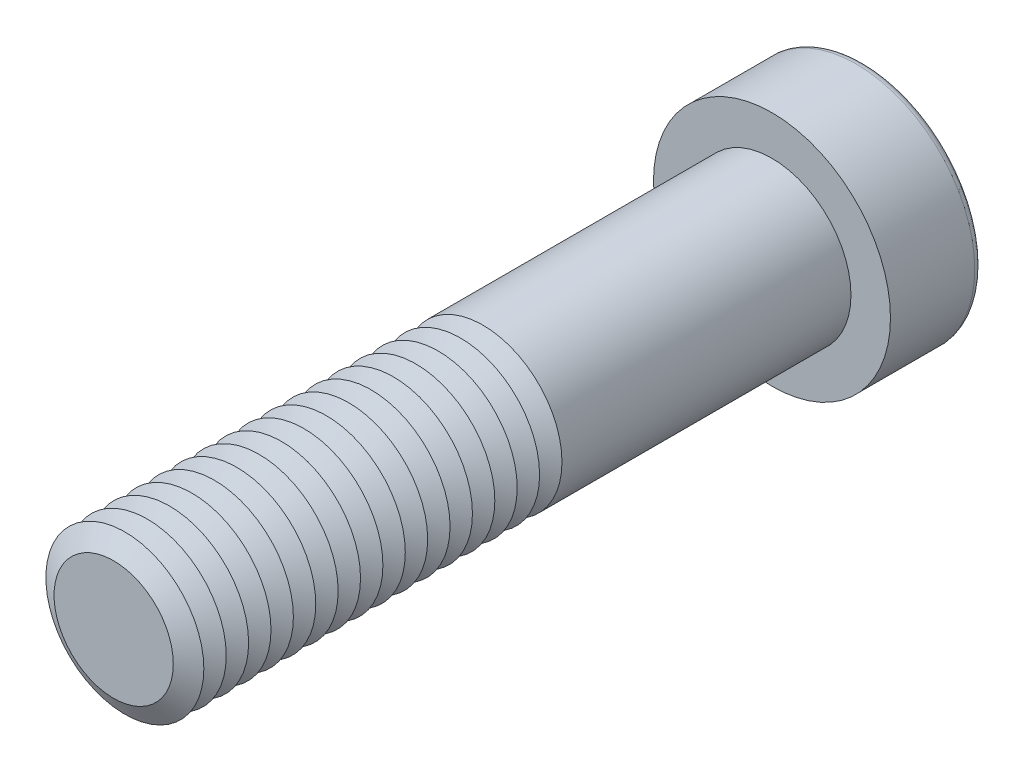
from build123d import *

# Parameters (mm, degrees)
SKETCH1_R           = 6
BOSS_EXTRUDE1_DEPTH = 50
SKETCH2_R           = 9
BOSS_EXTRUDE2_DEPTH = 7
CUT_EXTRUDE1_DEPTH  = 6
FILLET1_R           = 0.6
LPATTERN1_COUNT     = 17
LPATTERN1_PITCH     = 1.7


with BuildPart() as part:
    # Sketch1 → Boss-Extrude1 (new body)
    with BuildSketch(Plane.XY):
        Circle(SKETCH1_R)
    extrude(amount=BOSS_EXTRUDE1_DEPTH)

    # Sketch2 → Boss-Extrude2 (add)
    with BuildSketch(Plane(origin=(0, 0, 0), x_dir=(-1, 0, 0), z_dir=(0, 0, -1))):
        Circle(SKETCH2_R)
    extrude(amount=BOSS_EXTRUDE2_DEPTH)

    # Sketch3 → Cut-Extrude1 (cut)
    with BuildSketch(Plane(origin=(0, 0, -7), x_dir=(-1, 0, 0), z_dir=(0, 0, -1))):
        Polygon((-2.309401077, 4), (-4.618802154, 0), (-2.309401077, -4), (2.309401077, -4), (4.618802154, 0), (2.309401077, 4), align=None)
    extrude(amount=-CUT_EXTRUDE1_DEPTH, mode=Mode.SUBTRACT)

    # Fillet1
    fillet1_edges = [part.edges().sort_by_distance(p)[0] for p in [
        (9, 0, -7),
    ]]
    fillet(fillet1_edges, radius=FILLET1_R)

    # Cut-Extrude2 cone 1 section (on through the dimple's axis) → Cut-Extrude2 (revolve, cut)
    with BuildSketch(Plane(origin=(0, 0, -1), x_dir=(0, 1, 0), z_dir=(1, 0, 0))):
        Polygon((0, 0), (4, 0), (0, 2.309401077), align=None)
    revolve(axis=Axis((0, 0, -1), (0, 0, 1)), mode=Mode.SUBTRACT)

    # Cut-Extrude3 cone 1 section (on through the dimple's axis) → Cut-Extrude3 (revolve, cut)
    with BuildSketch(Plane(origin=(0, 0, -7), x_dir=(0, 1, 0), z_dir=(1, 0, 0))):
        Polygon((0, 0), (4.618802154, 0), (0, 1.237604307), align=None)
    revolve(axis=Axis((0, 0, -7), (0, 0, 1)), mode=Mode.SUBTRACT)

    # Sketch7 → Cut-Revolve1 (revolve, cut)
    with BuildSketch(Plane(origin=(0, 0, 0), x_dir=(0, 0, -1), z_dir=(1, 0, 0)), mode=Mode.PRIVATE) as cut_revolve1_sk:
        Polygon((-50, 4.527756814), (-49.15, 6), (-50.85, 6), align=None)
    cut_revolve1 = revolve(cut_revolve1_sk.sketch.rotate(Axis((0, 0, 50), (0, 0, -1)), 90), axis=Axis((0, 0, 50), (0, 0, -1)), mode=Mode.SUBTRACT)

    # LPattern1: Cut-Revolve1 ×17
    with Locations(*[(0, 0, -i * LPATTERN1_PITCH) for i in range(1, LPATTERN1_COUNT)]):
        add(cut_revolve1, mode=Mode.SUBTRACT)


solid = part.part
